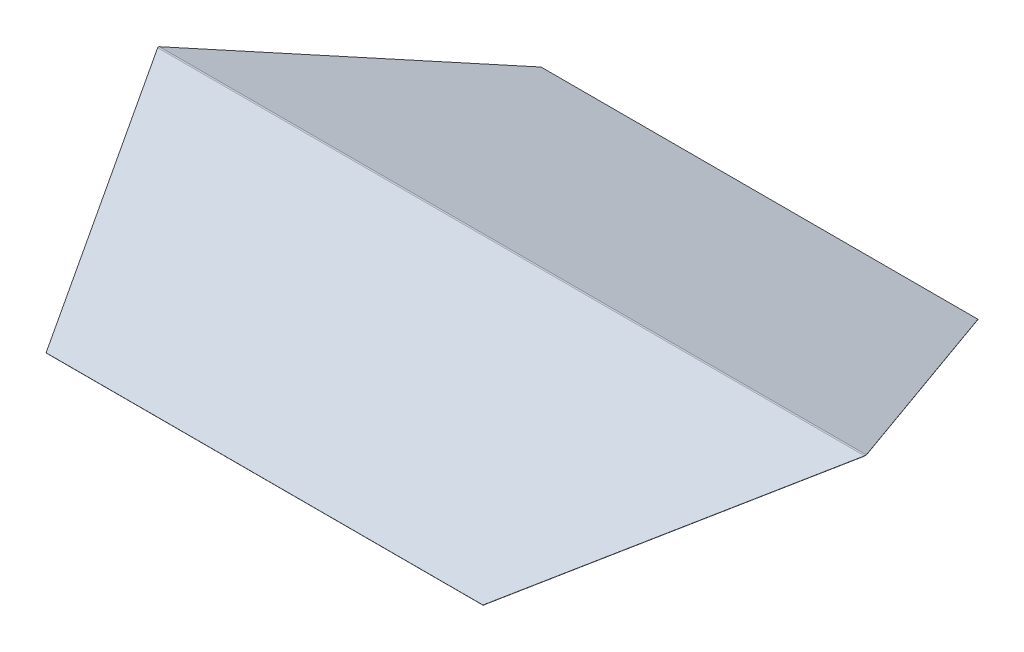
from build123d import *

# Parameters (mm, degrees)
BOSS_EXTRU_1_DEPTH           = 2500
BOSS_EXTRU_1_DEPTH_BACK      = 2500
ENL_V_MAT_EXTRU_1_DEPTH      = 3093.571398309
ENL_V_MAT_EXTRU_1_DEPTH_BACK = 3093.571398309
BOSS_EXTRU_2_START           = 1545
BOSS_EXTRU_2_DEPTH           = 1
BOSS_EXTRU_3_START           = -3091
BOSS_EXTRU_3_DEPTH           = 1


with BuildPart() as part:
    # Esquisse1 → Boss.-Extru.1 (new, two sides: drawn at the far end of the back side and taken through both)
    with BuildSketch(Plane(origin=(0, 0, 0), x_dir=(0, 0, -1), z_dir=(1, 0, 0)).offset(-BOSS_EXTRU_1_DEPTH_BACK)):
        with BuildLine():
            Line((5.705411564, 19.168940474), (1750, -500))
            Line((1750, -500), (1750.427905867, -498.562329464))
            Line((1750.427905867, -498.562329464), (6.133317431, 20.606611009))
            ThreePointArc((6.133317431, 20.606611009), (0, 21.5), (-6.133317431, 20.606611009))
            Line((-6.133317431, 20.606611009), (-1750.427905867, -498.562329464))
            Line((-1750.427905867, -498.562329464), (-1750, -500))
            Line((-1750, -500), (-5.705411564, 19.168940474))
            ThreePointArc((-5.705411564, 19.168940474), (0, 20), (5.705411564, 19.168940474))
        make_face()
    extrude(amount=BOSS_EXTRU_1_DEPTH + BOSS_EXTRU_1_DEPTH_BACK)

    # Esquisse2 → Enl_v. mat.-Extru.1 (cut, two sides: drawn at the far end of the back side and taken through both)
    with BuildSketch(Plane(origin=(0, 0, 0), x_dir=(1, 0, 0), z_dir=(0, 1, 0)).offset(-ENL_V_MAT_EXTRU_1_DEPTH_BACK)):
        Polygon((-1545, 1750.427905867), (-2500, 6.133317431), (-2500, 1750.427905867), align=None)
        Polygon((-2500, -6.133317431), (-1545, -1750.427905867), (-2500, -1750.427905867), align=None)
        Polygon((1545, 1750.427905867), (2500, 6.133317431), (2500, 1750.427905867), align=None)
        Polygon((2500, -6.133317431), (1545, -1750.427905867), (2500, -1750.427905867), align=None)
    extrude(amount=ENL_V_MAT_EXTRU_1_DEPTH + ENL_V_MAT_EXTRU_1_DEPTH_BACK, mode=Mode.SUBTRACT)

    # Esquisse3 → Boss.-Extru.2 (add)
    with BuildSketch(Plane(origin=(0, 0, 0), x_dir=(0, 0, -1), z_dir=(1, 0, 0)).offset(BOSS_EXTRU_2_START)):
        Polygon((1750, -500), (-1750, -500), (-120.505611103, -15), (120.505611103, -15), align=None)
    extrude(amount=BOSS_EXTRU_2_DEPTH)

    # Esquisse4 → Boss.-Extru.3 (add)
    with BuildSketch(Plane(origin=(1546, 0, 0), x_dir=(0, 0, -1), z_dir=(1, 0, 0)).offset(BOSS_EXTRU_3_START)):
        Polygon((-1750, -500), (1750, -500), (120.505611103, -15), (-120.505611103, -15), align=None)
    extrude(amount=-BOSS_EXTRU_3_DEPTH)


solid = part.part
